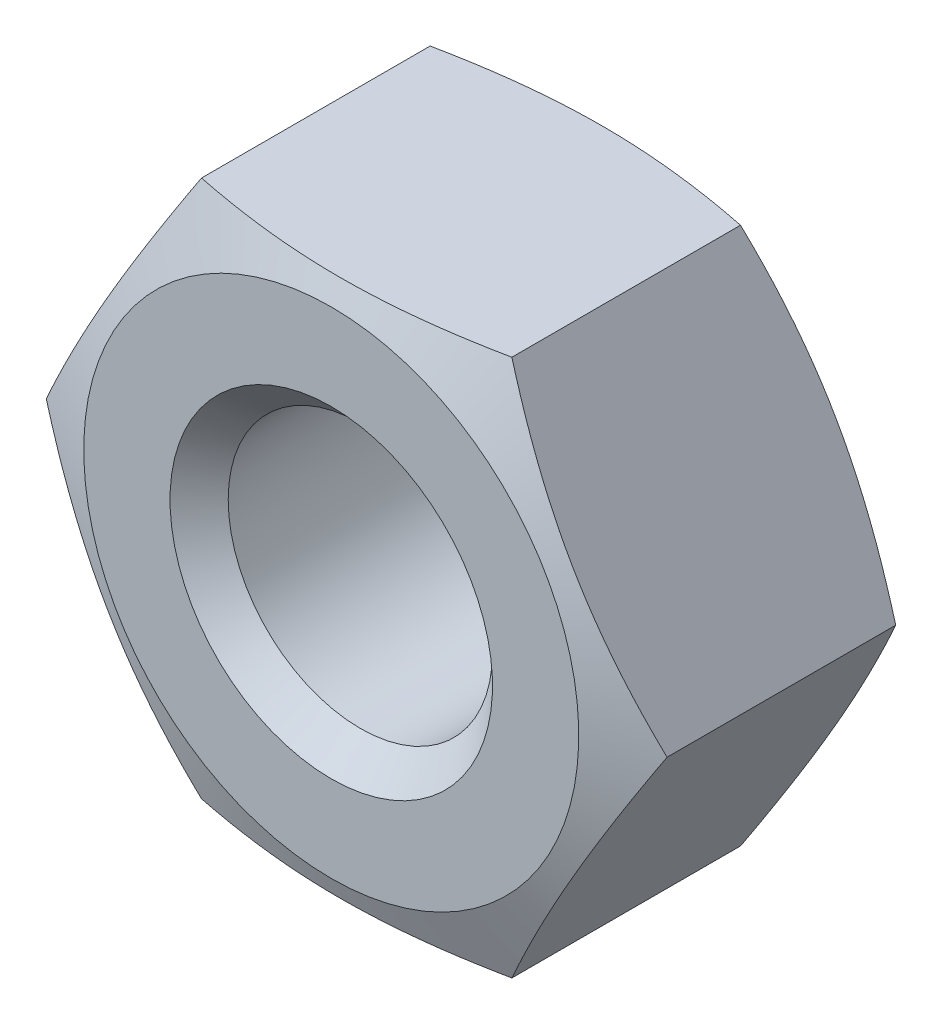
ISO-10303-21;
HEADER;
FILE_DESCRIPTION(('STEP AP214'),'2;1');
FILE_NAME('part.step','',(''),(''),'','','');
FILE_SCHEMA(('AUTOMOTIVE_DESIGN { 1 0 10303 214 1 1 1 1 }'));
ENDSEC;
DATA;
#1=APPLICATION_CONTEXT('core data for automotive mechanical design processes');
#2=APPLICATION_PROTOCOL_DEFINITION('international standard','automotive_design',2000,#1);
#3=PRODUCT_CONTEXT('',#1,'mechanical');
#4=PRODUCT('Part','Part','',(#3));
#5=PRODUCT_RELATED_PRODUCT_CATEGORY('part','',(#4));
#6=PRODUCT_DEFINITION_FORMATION('','',#4);
#7=PRODUCT_DEFINITION_CONTEXT('part definition',#1,'design');
#8=PRODUCT_DEFINITION('design','',#6,#7);
#9=PRODUCT_DEFINITION_SHAPE('','',#8);
#10=(LENGTH_UNIT() NAMED_UNIT(*) SI_UNIT(.MILLI.,.METRE.));
#11=(NAMED_UNIT(*) PLANE_ANGLE_UNIT() SI_UNIT($,.RADIAN.));
#12=(NAMED_UNIT(*) SI_UNIT($,.STERADIAN.) SOLID_ANGLE_UNIT());
#13=UNCERTAINTY_MEASURE_WITH_UNIT(LENGTH_MEASURE(1.E-05),#10,'distance_accuracy_value','');
#14=(GEOMETRIC_REPRESENTATION_CONTEXT(3) GLOBAL_UNCERTAINTY_ASSIGNED_CONTEXT((#13)) GLOBAL_UNIT_ASSIGNED_CONTEXT((#10,
#11,#12)) REPRESENTATION_CONTEXT('',''));
#15=CARTESIAN_POINT('',(0.,0.,0.));
#16=DIRECTION('',(0.,0.,1.));
#17=DIRECTION('',(1.,0.,0.));
#18=AXIS2_PLACEMENT_3D('',#15,#16,#17);
#19=CARTESIAN_POINT('',(5.775,0.,5.2));
#20=DIRECTION('',(0.,0.,1.));
#21=DIRECTION('',(1.,0.,0.));
#22=AXIS2_PLACEMENT_3D('',#19,#20,#21);
#23=PLANE('',#22);
#24=CARTESIAN_POINT('',(0.,0.,5.2));
#25=DIRECTION('',(0.,0.,-1.));
#26=DIRECTION('',(0.,1.,0.));
#27=AXIS2_PLACEMENT_3D('',#24,#25,#26);
#28=CIRCLE('',#27,3.);
#29=CARTESIAN_POINT('',(0.,3.,5.2));
#30=VERTEX_POINT('',#29);
#31=EDGE_CURVE('E206',#30,#30,#28,.T.);
#32=ORIENTED_EDGE('',*,*,#31,.T.);
#33=EDGE_LOOP('',(#32));
#34=FACE_BOUND('',#33,.T.);
#35=CARTESIAN_POINT('',(0.,0.,5.2));
#36=DIRECTION('',(0.,0.,-1.));
#37=DIRECTION('',(0.,1.,0.));
#38=AXIS2_PLACEMENT_3D('',#35,#36,#37);
#39=CIRCLE('',#38,4.60495894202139);
#40=CARTESIAN_POINT('',(0.,4.60495894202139,5.2));
#41=VERTEX_POINT('',#40);
#42=EDGE_CURVE('E209',#41,#41,#39,.T.);
#43=ORIENTED_EDGE('',*,*,#42,.F.);
#44=EDGE_LOOP('',(#43));
#45=FACE_BOUND('',#44,.T.);
#46=ADVANCED_FACE('F15',(#34,#45),#23,.T.);
#47=CARTESIAN_POINT('',(0.,0.,5.2));
#48=DIRECTION('',(0.,0.,1.));
#49=DIRECTION('',(0.,-1.,0.));
#50=AXIS2_PLACEMENT_3D('',#47,#48,#49);
#51=CONICAL_SURFACE('',#50,3.,0.785398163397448);
#52=CARTESIAN_POINT('',(0.,0.,4.65875));
#53=DIRECTION('',(0.,0.,-1.));
#54=DIRECTION('',(0.,1.,0.));
#55=AXIS2_PLACEMENT_3D('',#52,#53,#54);
#56=CIRCLE('',#55,2.45875);
#57=CARTESIAN_POINT('',(0.,2.45875,4.65875));
#58=VERTEX_POINT('',#57);
#59=EDGE_CURVE('E96',#58,#58,#56,.T.);
#60=ORIENTED_EDGE('',*,*,#59,.T.);
#61=EDGE_LOOP('',(#60));
#62=FACE_BOUND('',#61,.T.);
#63=ORIENTED_EDGE('',*,*,#31,.F.);
#64=EDGE_LOOP('',(#63));
#65=FACE_BOUND('',#64,.T.);
#66=ADVANCED_FACE('F139',(#62,#65),#51,.F.);
#67=CARTESIAN_POINT('',(0.,0.,0.));
#68=DIRECTION('',(0.,0.,-1.));
#69=DIRECTION('',(0.,1.,0.));
#70=AXIS2_PLACEMENT_3D('',#67,#68,#69);
#71=CYLINDRICAL_SURFACE('',#70,2.45875);
#72=CARTESIAN_POINT('',(0.,0.,0.54125));
#73=DIRECTION('',(0.,0.,-1.));
#74=DIRECTION('',(0.,1.,0.));
#75=AXIS2_PLACEMENT_3D('',#72,#73,#74);
#76=CIRCLE('',#75,2.45875);
#77=CARTESIAN_POINT('',(0.,2.45875,0.54125));
#78=VERTEX_POINT('',#77);
#79=EDGE_CURVE('E93',#78,#78,#76,.T.);
#80=ORIENTED_EDGE('',*,*,#79,.T.);
#81=EDGE_LOOP('',(#80));
#82=FACE_BOUND('',#81,.T.);
#83=ORIENTED_EDGE('',*,*,#59,.F.);
#84=EDGE_LOOP('',(#83));
#85=FACE_BOUND('',#84,.T.);
#86=ADVANCED_FACE('F201',(#82,#85),#71,.F.);
#87=CARTESIAN_POINT('',(0.,0.,0.));
#88=DIRECTION('',(0.,0.,-1.));
#89=DIRECTION('',(0.,1.,0.));
#90=AXIS2_PLACEMENT_3D('',#87,#88,#89);
#91=CONICAL_SURFACE('',#90,3.,0.785398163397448);
#92=ORIENTED_EDGE('',*,*,#79,.F.);
#93=EDGE_LOOP('',(#92));
#94=FACE_BOUND('',#93,.T.);
#95=CARTESIAN_POINT('',(0.,0.,0.));
#96=DIRECTION('',(0.,0.,-1.));
#97=DIRECTION('',(0.,1.,0.));
#98=AXIS2_PLACEMENT_3D('',#95,#96,#97);
#99=CIRCLE('',#98,3.);
#100=CARTESIAN_POINT('',(0.,3.,0.));
#101=VERTEX_POINT('',#100);
#102=EDGE_CURVE('E210',#101,#101,#99,.T.);
#103=ORIENTED_EDGE('',*,*,#102,.T.);
#104=EDGE_LOOP('',(#103));
#105=FACE_BOUND('',#104,.T.);
#106=ADVANCED_FACE('F137',(#94,#105),#91,.F.);
#107=CARTESIAN_POINT('',(0.,0.,4.72727272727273));
#108=DIRECTION('',(0.,0.,-1.));
#109=DIRECTION('',(0.,1.,0.));
#110=AXIS2_PLACEMENT_3D('',#107,#108,#109);
#111=CONICAL_SURFACE('',#110,5.775,1.18682389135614);
#112=ORIENTED_EDGE('',*,*,#42,.T.);
#113=EDGE_LOOP('',(#112));
#114=FACE_BOUND('',#113,.T.);
#115=CARTESIAN_POINT('',(-7.63252428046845,-5.00129670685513,3.37372353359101));
#116=CARTESIAN_POINT('',(-7.40692872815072,-5.00129670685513,3.4499392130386));
#117=CARTESIAN_POINT('',(-7.18103301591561,-5.00129670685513,3.52528282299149));
#118=CARTESIAN_POINT('',(-6.72848595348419,-5.00129670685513,3.67373862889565));
#119=CARTESIAN_POINT('',(-6.50183453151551,-5.00129670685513,3.74685060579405));
#120=CARTESIAN_POINT('',(-6.04711659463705,-5.00129670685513,3.89051397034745));
#121=CARTESIAN_POINT('',(-5.81904798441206,-5.00129670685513,3.961058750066));
#122=CARTESIAN_POINT('',(-5.36188060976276,-5.00129670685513,4.09872037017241));
#123=CARTESIAN_POINT('',(-5.13278187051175,-5.00129670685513,4.16583729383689));
#124=CARTESIAN_POINT('',(-4.67634647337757,-5.00129670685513,4.29493674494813));
#125=CARTESIAN_POINT('',(-4.44902554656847,-5.00129670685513,4.35697461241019));
#126=CARTESIAN_POINT('',(-3.99300093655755,-5.00129670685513,4.47580897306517));
#127=CARTESIAN_POINT('',(-3.7642972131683,-5.00129670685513,4.53260531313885));
#128=CARTESIAN_POINT('',(-3.30547385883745,-5.00129670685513,4.63959941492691));
#129=CARTESIAN_POINT('',(-3.07535509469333,-5.00129670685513,4.68980086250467));
#130=CARTESIAN_POINT('',(-2.6134821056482,-5.00129670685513,4.78205285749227));
#131=CARTESIAN_POINT('',(-2.38172799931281,-5.00129670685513,4.82410398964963));
#132=CARTESIAN_POINT('',(-1.96417992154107,-5.00129670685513,4.89070776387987));
#133=CARTESIAN_POINT('',(-1.77867771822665,-5.00129670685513,4.9170802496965));
#134=CARTESIAN_POINT('',(-1.40680055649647,-5.00129670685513,4.96267123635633));
#135=CARTESIAN_POINT('',(-1.22042567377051,-5.00129670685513,4.98189034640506));
#136=CARTESIAN_POINT('',(-0.847137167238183,-5.00129670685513,5.01241644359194));
#137=CARTESIAN_POINT('',(-0.660223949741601,-5.00129670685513,5.0237283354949));
#138=CARTESIAN_POINT('',(-0.286075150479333,-5.00129670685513,5.03796502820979));
#139=CARTESIAN_POINT('',(-0.0988395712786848,-5.00129670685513,5.04088989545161));
#140=CARTESIAN_POINT('',(0.276487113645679,-5.00129670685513,5.03821110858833));
#141=CARTESIAN_POINT('',(0.464577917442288,-5.00129670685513,5.03256560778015));
#142=CARTESIAN_POINT('',(0.840320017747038,-5.00129670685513,5.012928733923));
#143=CARTESIAN_POINT('',(1.02797130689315,-5.00129670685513,4.99893722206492));
#144=CARTESIAN_POINT('',(1.40264529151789,-5.00129670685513,4.96319595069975));
#145=CARTESIAN_POINT('',(1.58966750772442,-5.00129670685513,4.94144123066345));
#146=CARTESIAN_POINT('',(1.96276160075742,-5.00129670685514,4.89099430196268));
#147=CARTESIAN_POINT('',(2.14883348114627,-5.00129670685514,4.86230211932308));
#148=CARTESIAN_POINT('',(2.552742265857,-5.00129670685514,4.79328214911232));
#149=CARTESIAN_POINT('',(2.77037963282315,-5.00129670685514,4.75179408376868));
#150=CARTESIAN_POINT('',(3.20422689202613,-5.00129670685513,4.66191009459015));
#151=CARTESIAN_POINT('',(3.4204366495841,-5.00129670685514,4.6135135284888));
#152=CARTESIAN_POINT('',(3.85162355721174,-5.00129670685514,4.51107243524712));
#153=CARTESIAN_POINT('',(4.06660000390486,-5.00129670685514,4.45702496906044));
#154=CARTESIAN_POINT('',(4.49534169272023,-5.00129670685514,4.34438143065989));
#155=CARTESIAN_POINT('',(4.70910698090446,-5.00129670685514,4.28578553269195));
#156=CARTESIAN_POINT('',(5.13615898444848,-5.00129670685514,4.16475602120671));
#157=CARTESIAN_POINT('',(5.34944290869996,-5.00129670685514,4.10231260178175));
#158=CARTESIAN_POINT('',(5.77510931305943,-5.00129670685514,3.97442325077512));
#159=CARTESIAN_POINT('',(5.98749177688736,-5.00129670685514,3.90897726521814));
#160=CARTESIAN_POINT('',(6.62336729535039,-5.00129670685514,3.70903642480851));
#161=CARTESIAN_POINT('',(7.0457148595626,-5.00129670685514,3.57090210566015));
#162=CARTESIAN_POINT('',(7.88526486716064,-5.00129670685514,3.28906291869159));
#163=CARTESIAN_POINT('',(8.30248267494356,-5.00129670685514,3.14540337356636));
#164=CARTESIAN_POINT('',(9.13534876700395,-5.00129670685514,2.85351349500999));
#165=CARTESIAN_POINT('',(9.5509969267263,-5.00129670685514,2.7052828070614));
#166=CARTESIAN_POINT('',(10.3783206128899,-5.00129670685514,2.40652816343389));
#167=CARTESIAN_POINT('',(10.7900041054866,-5.00129670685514,2.25602620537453));
#168=CARTESIAN_POINT('',(11.4068301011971,-5.00129670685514,2.0284628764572));
#169=CARTESIAN_POINT('',(11.6123091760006,-5.00129670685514,1.9523116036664));
#170=CARTESIAN_POINT('',(12.0230684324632,-5.00129670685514,1.79947668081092));
#171=CARTESIAN_POINT('',(12.2283486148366,-5.00129670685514,1.72279303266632));
#172=CARTESIAN_POINT('',(12.4335427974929,-5.00129670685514,1.64587999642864));
#173=B_SPLINE_CURVE_WITH_KNOTS('',3,(#115,#116,#117,#118,#119,#120,#121,#122,#123,#124,#125,
#126,#127,#128,#129,#130,#131,#132,#133,#134,#135,#136,#137,#138,#139,#140,#141,#142,#143,#144,
#145,#146,#147,#148,#149,#150,#151,#152,#153,#154,#155,#156,#157,#158,#159,#160,#161,#162,#163,
#164,#165,#166,#167,#168,#169,#170,#171,#172),.UNSPECIFIED.,.F.,.F.,(4,2,2,2,2,2,2,2,2,2,2,2,2,
2,2,2,2,2,2,2,2,2,2,2,2,2,2,2,4),(0.,0.714372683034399,1.42881526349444,2.1449826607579,
2.86113265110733,3.5679862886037,4.27486056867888,4.98133808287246,5.68776489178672,
6.24974766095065,6.81168255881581,7.37326858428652,7.93485016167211,8.49918261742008,
9.06352445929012,9.62822755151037,10.192928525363,10.8574572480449,11.5220477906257,
12.1869857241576,12.8518981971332,13.5185816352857,14.1852770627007,15.5182733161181,
16.8420167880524,18.1658631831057,19.4808464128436,20.1382543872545,20.7956599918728),.UNSPECIFIED.);
#174=CARTESIAN_POINT('',(-2.8875,-5.00129670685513,4.72727272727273));
#175=VERTEX_POINT('',#174);
#176=CARTESIAN_POINT('',(2.8875,-5.00129670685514,4.72727272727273));
#177=VERTEX_POINT('',#176);
#178=EDGE_CURVE('E76',#175,#177,#173,.T.);
#179=ORIENTED_EDGE('',*,*,#178,.T.);
#180=CARTESIAN_POINT('',(2.88749988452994,-5.00129690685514,4.7272726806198));
#181=CARTESIAN_POINT('',(2.98838133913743,-4.82656510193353,4.76803377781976));
#182=CARTESIAN_POINT('',(3.08959576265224,-4.65125657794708,4.80572396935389));
#183=CARTESIAN_POINT('',(3.29269387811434,-4.29948032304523,4.8738041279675));
#184=CARTESIAN_POINT('',(3.39457792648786,-4.12301197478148,4.90418981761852));
#185=CARTESIAN_POINT('',(3.59887027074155,-3.76916725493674,4.95644441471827));
#186=CARTESIAN_POINT('',(3.70127840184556,-3.59179116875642,4.97831585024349));
#187=CARTESIAN_POINT('',(3.90647506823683,-3.23638011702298,5.01252838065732));
#188=CARTESIAN_POINT('',(4.00926351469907,-3.05834530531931,5.02487157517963));
#189=CARTESIAN_POINT('',(4.21327560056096,-2.70498600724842,5.03926004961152));
#190=CARTESIAN_POINT('',(4.31449617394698,-2.52966683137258,5.04147663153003));
#191=CARTESIAN_POINT('',(4.51687750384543,-2.1791320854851,5.03595848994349));
#192=CARTESIAN_POINT('',(4.61803825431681,-2.00391652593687,5.02822289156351));
#193=CARTESIAN_POINT('',(4.81999440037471,-1.65411822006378,5.00321623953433));
#194=CARTESIAN_POINT('',(4.92078998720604,-1.47953514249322,4.98595124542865));
#195=CARTESIAN_POINT('',(5.1218999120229,-1.13120253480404,4.94272250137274));
#196=CARTESIAN_POINT('',(5.22221429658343,-0.957452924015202,4.91675961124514));
#197=CARTESIAN_POINT('',(5.36007420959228,-0.718672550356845,4.87571979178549));
#198=CARTESIAN_POINT('',(5.39787092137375,-0.65320672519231,4.86390986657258));
#199=CARTESIAN_POINT('',(5.4733751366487,-0.522429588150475,4.83926160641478));
#200=CARTESIAN_POINT('',(5.51108265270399,-0.457118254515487,4.82642342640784));
#201=CARTESIAN_POINT('',(5.58654068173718,-0.326421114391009,4.79973234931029));
#202=CARTESIAN_POINT('',(5.62429089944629,-0.26103581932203,4.78587612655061));
#203=CARTESIAN_POINT('',(5.69970862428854,-0.130408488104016,4.75724675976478));
#204=CARTESIAN_POINT('',(5.73737612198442,-0.0651664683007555,4.74247351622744));
#205=CARTESIAN_POINT('',(5.77500011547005,2.00000000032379E-07,4.7272726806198));
#206=B_SPLINE_CURVE_WITH_KNOTS('',3,(#180,#181,#182,#183,#184,#185,#186,#187,#188,#189,#190,
#191,#192,#193,#194,#195,#196,#197,#198,#199,#200,#201,#202,#203,#204,#205),.UNSPECIFIED.,.F.,
.F.,(4,2,2,2,2,2,2,2,2,2,2,2,4),(0.,0.617560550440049,1.2354818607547,1.85321955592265,
2.47082108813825,3.07793560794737,3.68510350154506,4.29188575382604,4.89860804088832,
5.12813487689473,5.3576271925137,5.58790573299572,5.81820930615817),.UNSPECIFIED.);
#207=CARTESIAN_POINT('',(5.775,0.,4.72727272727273));
#208=VERTEX_POINT('',#207);
#209=EDGE_CURVE('E161',#177,#208,#206,.T.);
#210=ORIENTED_EDGE('',*,*,#209,.T.);
#211=CARTESIAN_POINT('',(5.77500011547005,-2.00000000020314E-07,4.7272726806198));
#212=CARTESIAN_POINT('',(5.67411866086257,0.174731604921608,4.76803377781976));
#213=CARTESIAN_POINT('',(5.57290423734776,0.350040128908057,4.8057239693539));
#214=CARTESIAN_POINT('',(5.36980612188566,0.701816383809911,4.8738041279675));
#215=CARTESIAN_POINT('',(5.26792207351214,0.878284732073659,4.90418981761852));
#216=CARTESIAN_POINT('',(5.06362972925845,1.2321294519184,4.95644441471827));
#217=CARTESIAN_POINT('',(4.96122159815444,1.40950553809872,4.97831585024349));
#218=CARTESIAN_POINT('',(4.75602493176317,1.76491658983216,5.01252838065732));
#219=CARTESIAN_POINT('',(4.65323648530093,1.94295140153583,5.02487157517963));
#220=CARTESIAN_POINT('',(4.44922439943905,2.29631069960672,5.03926004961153));
#221=CARTESIAN_POINT('',(4.34800382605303,2.47162987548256,5.04147663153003));
#222=CARTESIAN_POINT('',(4.14562249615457,2.82216462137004,5.03595848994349));
#223=CARTESIAN_POINT('',(4.04446174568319,2.99738018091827,5.02822289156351));
#224=CARTESIAN_POINT('',(3.84250559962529,3.34717848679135,5.00321623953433));
#225=CARTESIAN_POINT('',(3.74171001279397,3.52176156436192,4.98595124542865));
#226=CARTESIAN_POINT('',(3.5406000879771,3.8700941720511,4.94272250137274));
#227=CARTESIAN_POINT('',(3.44028570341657,4.04384378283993,4.91675961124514));
#228=CARTESIAN_POINT('',(3.30242579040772,4.28262415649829,4.87571979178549));
#229=CARTESIAN_POINT('',(3.26462907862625,4.34808998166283,4.86390986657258));
#230=CARTESIAN_POINT('',(3.1891248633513,4.47886711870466,4.83926160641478));
#231=CARTESIAN_POINT('',(3.15141734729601,4.54417845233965,4.82642342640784));
#232=CARTESIAN_POINT('',(3.07595931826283,4.67487559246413,4.79973234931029));
#233=CARTESIAN_POINT('',(3.03820910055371,4.74026088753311,4.78587612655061));
#234=CARTESIAN_POINT('',(2.96279137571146,4.87088821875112,4.75724675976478));
#235=CARTESIAN_POINT('',(2.92512387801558,4.93613023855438,4.74247351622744));
#236=CARTESIAN_POINT('',(2.88749988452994,5.00129690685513,4.7272726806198));
#237=B_SPLINE_CURVE_WITH_KNOTS('',3,(#211,#212,#213,#214,#215,#216,#217,#218,#219,#220,#221,
#222,#223,#224,#225,#226,#227,#228,#229,#230,#231,#232,#233,#234,#235,#236),.UNSPECIFIED.,.F.,
.F.,(4,2,2,2,2,2,2,2,2,2,2,2,4),(0.,0.617560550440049,1.2354818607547,1.85321955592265,
2.47082108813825,3.07793560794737,3.68510350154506,4.29188575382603,4.89860804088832,
5.12813487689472,5.35762719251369,5.58790573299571,5.81820930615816),.UNSPECIFIED.);
#238=CARTESIAN_POINT('',(2.8875,5.00129670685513,4.72727272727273));
#239=VERTEX_POINT('',#238);
#240=EDGE_CURVE('E38',#208,#239,#237,.T.);
#241=ORIENTED_EDGE('',*,*,#240,.T.);
#242=CARTESIAN_POINT('',(-7.63252428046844,5.00129670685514,3.37372353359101));
#243=CARTESIAN_POINT('',(-7.40692872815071,5.00129670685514,3.4499392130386));
#244=CARTESIAN_POINT('',(-7.1810330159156,5.00129670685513,3.52528282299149));
#245=CARTESIAN_POINT('',(-6.72848595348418,5.00129670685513,3.67373862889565));
#246=CARTESIAN_POINT('',(-6.50183453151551,5.00129670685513,3.74685060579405));
#247=CARTESIAN_POINT('',(-6.04711659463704,5.00129670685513,3.89051397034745));
#248=CARTESIAN_POINT('',(-5.81904798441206,5.00129670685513,3.961058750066));
#249=CARTESIAN_POINT('',(-5.36188060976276,5.00129670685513,4.09872037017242));
#250=CARTESIAN_POINT('',(-5.13278187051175,5.00129670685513,4.16583729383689));
#251=CARTESIAN_POINT('',(-4.67634647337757,5.00129670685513,4.29493674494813));
#252=CARTESIAN_POINT('',(-4.44902554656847,5.00129670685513,4.35697461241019));
#253=CARTESIAN_POINT('',(-3.99300093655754,5.00129670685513,4.47580897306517));
#254=CARTESIAN_POINT('',(-3.7642972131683,5.00129670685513,4.53260531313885));
#255=CARTESIAN_POINT('',(-3.30547385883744,5.00129670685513,4.63959941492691));
#256=CARTESIAN_POINT('',(-3.07535509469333,5.00129670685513,4.68980086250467));
#257=CARTESIAN_POINT('',(-2.61348210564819,5.00129670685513,4.78205285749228));
#258=CARTESIAN_POINT('',(-2.3817279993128,5.00129670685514,4.82410398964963));
#259=CARTESIAN_POINT('',(-1.96417992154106,5.00129670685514,4.89070776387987));
#260=CARTESIAN_POINT('',(-1.77867771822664,5.00129670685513,4.9170802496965));
#261=CARTESIAN_POINT('',(-1.40680055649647,5.00129670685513,4.96267123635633));
#262=CARTESIAN_POINT('',(-1.2204256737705,5.00129670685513,4.98189034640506));
#263=CARTESIAN_POINT('',(-0.847137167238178,5.00129670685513,5.01241644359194));
#264=CARTESIAN_POINT('',(-0.660223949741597,5.00129670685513,5.0237283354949));
#265=CARTESIAN_POINT('',(-0.286075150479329,5.00129670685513,5.03796502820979));
#266=CARTESIAN_POINT('',(-0.0988395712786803,5.00129670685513,5.04088989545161));
#267=CARTESIAN_POINT('',(0.276487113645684,5.00129670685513,5.03821110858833));
#268=CARTESIAN_POINT('',(0.464577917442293,5.00129670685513,5.03256560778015));
#269=CARTESIAN_POINT('',(0.840320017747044,5.00129670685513,5.012928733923));
#270=CARTESIAN_POINT('',(1.02797130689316,5.00129670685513,4.99893722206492));
#271=CARTESIAN_POINT('',(1.40264529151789,5.00129670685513,4.96319595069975));
#272=CARTESIAN_POINT('',(1.58966750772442,5.00129670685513,4.94144123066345));
#273=CARTESIAN_POINT('',(1.96276160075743,5.00129670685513,4.89099430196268));
#274=CARTESIAN_POINT('',(2.14883348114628,5.00129670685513,4.86230211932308));
#275=CARTESIAN_POINT('',(2.55274226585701,5.00129670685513,4.79328214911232));
#276=CARTESIAN_POINT('',(2.77037963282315,5.00129670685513,4.75179408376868));
#277=CARTESIAN_POINT('',(3.20422689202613,5.00129670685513,4.66191009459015));
#278=CARTESIAN_POINT('',(3.42043664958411,5.00129670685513,4.6135135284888));
#279=CARTESIAN_POINT('',(3.85162355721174,5.00129670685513,4.51107243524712));
#280=CARTESIAN_POINT('',(4.06660000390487,5.00129670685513,4.45702496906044));
#281=CARTESIAN_POINT('',(4.49534169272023,5.00129670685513,4.34438143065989));
#282=CARTESIAN_POINT('',(4.70910698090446,5.00129670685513,4.28578553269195));
#283=CARTESIAN_POINT('',(5.13615898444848,5.00129670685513,4.16475602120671));
#284=CARTESIAN_POINT('',(5.34944290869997,5.00129670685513,4.10231260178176));
#285=CARTESIAN_POINT('',(5.77510931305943,5.00129670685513,3.97442325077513));
#286=CARTESIAN_POINT('',(5.98749177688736,5.00129670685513,3.90897726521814));
#287=CARTESIAN_POINT('',(6.62336729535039,5.00129670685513,3.70903642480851));
#288=CARTESIAN_POINT('',(7.0457148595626,5.00129670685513,3.57090210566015));
#289=CARTESIAN_POINT('',(7.88526486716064,5.00129670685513,3.28906291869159));
#290=CARTESIAN_POINT('',(8.30248267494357,5.00129670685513,3.14540337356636));
#291=CARTESIAN_POINT('',(9.13534876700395,5.00129670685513,2.85351349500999));
#292=CARTESIAN_POINT('',(9.5509969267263,5.00129670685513,2.7052828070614));
#293=CARTESIAN_POINT('',(10.3783206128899,5.00129670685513,2.40652816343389));
#294=CARTESIAN_POINT('',(10.7900041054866,5.00129670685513,2.25602620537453));
#295=CARTESIAN_POINT('',(11.4068301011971,5.00129670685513,2.0284628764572));
#296=CARTESIAN_POINT('',(11.6123091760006,5.00129670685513,1.9523116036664));
#297=CARTESIAN_POINT('',(12.0230684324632,5.00129670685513,1.79947668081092));
#298=CARTESIAN_POINT('',(12.2283486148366,5.00129670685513,1.72279303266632));
#299=CARTESIAN_POINT('',(12.4335427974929,5.00129670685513,1.64587999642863));
#300=B_SPLINE_CURVE_WITH_KNOTS('',3,(#242,#243,#244,#245,#246,#247,#248,#249,#250,#251,#252,
#253,#254,#255,#256,#257,#258,#259,#260,#261,#262,#263,#264,#265,#266,#267,#268,#269,#270,#271,
#272,#273,#274,#275,#276,#277,#278,#279,#280,#281,#282,#283,#284,#285,#286,#287,#288,#289,#290,
#291,#292,#293,#294,#295,#296,#297,#298,#299),.UNSPECIFIED.,.F.,.F.,(4,2,2,2,2,2,2,2,2,2,2,2,2,
2,2,2,2,2,2,2,2,2,2,2,2,2,2,2,4),(0.,0.714372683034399,1.42881526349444,2.14498266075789,
2.86113265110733,3.5679862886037,4.27486056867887,4.98133808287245,5.68776489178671,
6.24974766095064,6.81168255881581,7.37326858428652,7.9348501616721,8.49918261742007,
9.06352445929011,9.62822755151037,10.192928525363,10.8574572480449,11.5220477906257,
12.1869857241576,12.8518981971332,13.5185816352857,14.1852770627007,15.5182733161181,
16.8420167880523,18.1658631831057,19.4808464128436,20.1382543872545,20.7956599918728),.UNSPECIFIED.);
#301=CARTESIAN_POINT('',(-2.8875,5.00129670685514,4.72727272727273));
#302=VERTEX_POINT('',#301);
#303=EDGE_CURVE('E152',#239,#302,#300,.F.);
#304=ORIENTED_EDGE('',*,*,#303,.T.);
#305=CARTESIAN_POINT('',(-2.88749988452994,5.00129690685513,4.7272726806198));
#306=CARTESIAN_POINT('',(-2.98838133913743,4.82656510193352,4.76803377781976));
#307=CARTESIAN_POINT('',(-3.08959576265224,4.65125657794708,4.80572396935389));
#308=CARTESIAN_POINT('',(-3.29269387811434,4.29948032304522,4.8738041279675));
#309=CARTESIAN_POINT('',(-3.39457792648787,4.12301197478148,4.90418981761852));
#310=CARTESIAN_POINT('',(-3.59887027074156,3.76916725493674,4.95644441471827));
#311=CARTESIAN_POINT('',(-3.70127840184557,3.59179116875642,4.97831585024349));
#312=CARTESIAN_POINT('',(-3.90647506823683,3.23638011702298,5.01252838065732));
#313=CARTESIAN_POINT('',(-4.00926351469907,3.05834530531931,5.02487157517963));
#314=CARTESIAN_POINT('',(-4.21327560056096,2.70498600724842,5.03926004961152));
#315=CARTESIAN_POINT('',(-4.31449617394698,2.52966683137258,5.04147663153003));
#316=CARTESIAN_POINT('',(-4.51687750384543,2.1791320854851,5.03595848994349));
#317=CARTESIAN_POINT('',(-4.61803825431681,2.00391652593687,5.02822289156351));
#318=CARTESIAN_POINT('',(-4.81999440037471,1.65411822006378,5.00321623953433));
#319=CARTESIAN_POINT('',(-4.92078998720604,1.47953514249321,4.98595124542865));
#320=CARTESIAN_POINT('',(-5.1218999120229,1.13120253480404,4.94272250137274));
#321=CARTESIAN_POINT('',(-5.22221429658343,0.957452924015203,4.91675961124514));
#322=CARTESIAN_POINT('',(-5.36007420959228,0.718672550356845,4.87571979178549));
#323=CARTESIAN_POINT('',(-5.39787092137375,0.65320672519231,4.86390986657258));
#324=CARTESIAN_POINT('',(-5.4733751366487,0.522429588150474,4.83926160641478));
#325=CARTESIAN_POINT('',(-5.511082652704,0.457118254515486,4.82642342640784));
#326=CARTESIAN_POINT('',(-5.58654068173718,0.326421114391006,4.79973234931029));
#327=CARTESIAN_POINT('',(-5.6242908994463,0.261035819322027,4.78587612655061));
#328=CARTESIAN_POINT('',(-5.69970862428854,0.130408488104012,4.75724675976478));
#329=CARTESIAN_POINT('',(-5.73737612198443,0.065166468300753,4.74247351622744));
#330=CARTESIAN_POINT('',(-5.77500011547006,-1.99999999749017E-07,4.7272726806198));
#331=B_SPLINE_CURVE_WITH_KNOTS('',3,(#305,#306,#307,#308,#309,#310,#311,#312,#313,#314,#315,
#316,#317,#318,#319,#320,#321,#322,#323,#324,#325,#326,#327,#328,#329,#330),.UNSPECIFIED.,.F.,
.F.,(4,2,2,2,2,2,2,2,2,2,2,2,4),(0.,0.617560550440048,1.2354818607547,1.85321955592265,
2.47082108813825,3.07793560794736,3.68510350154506,4.29188575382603,4.89860804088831,
5.12813487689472,5.35762719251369,5.58790573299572,5.81820930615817),.UNSPECIFIED.);
#332=CARTESIAN_POINT('',(-5.775,0.,4.72727272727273));
#333=VERTEX_POINT('',#332);
#334=EDGE_CURVE('E147',#302,#333,#331,.T.);
#335=ORIENTED_EDGE('',*,*,#334,.T.);
#336=CARTESIAN_POINT('',(-5.77500011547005,1.999999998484E-07,4.7272726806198));
#337=CARTESIAN_POINT('',(-5.67411866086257,-0.174731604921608,4.76803377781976));
#338=CARTESIAN_POINT('',(-5.57290423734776,-0.350040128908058,4.8057239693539));
#339=CARTESIAN_POINT('',(-5.36980612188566,-0.701816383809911,4.8738041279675));
#340=CARTESIAN_POINT('',(-5.26792207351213,-0.878284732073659,4.90418981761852));
#341=CARTESIAN_POINT('',(-5.06362972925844,-1.2321294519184,4.95644441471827));
#342=CARTESIAN_POINT('',(-4.96122159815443,-1.40950553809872,4.97831585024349));
#343=CARTESIAN_POINT('',(-4.75602493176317,-1.76491658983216,5.01252838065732));
#344=CARTESIAN_POINT('',(-4.65323648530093,-1.94295140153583,5.02487157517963));
#345=CARTESIAN_POINT('',(-4.44922439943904,-2.29631069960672,5.03926004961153));
#346=CARTESIAN_POINT('',(-4.34800382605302,-2.47162987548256,5.04147663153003));
#347=CARTESIAN_POINT('',(-4.14562249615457,-2.82216462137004,5.03595848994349));
#348=CARTESIAN_POINT('',(-4.04446174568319,-2.99738018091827,5.02822289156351));
#349=CARTESIAN_POINT('',(-3.84250559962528,-3.34717848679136,5.00321623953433));
#350=CARTESIAN_POINT('',(-3.74171001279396,-3.52176156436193,4.98595124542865));
#351=CARTESIAN_POINT('',(-3.5406000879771,-3.8700941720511,4.94272250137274));
#352=CARTESIAN_POINT('',(-3.44028570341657,-4.04384378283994,4.91675961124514));
#353=CARTESIAN_POINT('',(-3.30242579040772,-4.2826241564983,4.87571979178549));
#354=CARTESIAN_POINT('',(-3.26462907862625,-4.34808998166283,4.86390986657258));
#355=CARTESIAN_POINT('',(-3.1891248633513,-4.47886711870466,4.83926160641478));
#356=CARTESIAN_POINT('',(-3.15141734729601,-4.54417845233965,4.82642342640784));
#357=CARTESIAN_POINT('',(-3.07595931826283,-4.67487559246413,4.79973234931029));
#358=CARTESIAN_POINT('',(-3.03820910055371,-4.7402608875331,4.78587612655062));
#359=CARTESIAN_POINT('',(-2.96279137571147,-4.87088821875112,4.75724675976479));
#360=CARTESIAN_POINT('',(-2.92512387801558,-4.93613023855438,4.74247351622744));
#361=CARTESIAN_POINT('',(-2.88749988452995,-5.00129690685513,4.7272726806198));
#362=B_SPLINE_CURVE_WITH_KNOTS('',3,(#336,#337,#338,#339,#340,#341,#342,#343,#344,#345,#346,
#347,#348,#349,#350,#351,#352,#353,#354,#355,#356,#357,#358,#359,#360,#361),.UNSPECIFIED.,.F.,
.F.,(4,2,2,2,2,2,2,2,2,2,2,2,4),(0.,0.61756055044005,1.2354818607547,1.85321955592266,
2.47082108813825,3.07793560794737,3.68510350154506,4.29188575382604,4.89860804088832,
5.12813487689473,5.35762719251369,5.58790573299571,5.81820930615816),.UNSPECIFIED.);
#363=EDGE_CURVE('E124',#333,#175,#362,.T.);
#364=ORIENTED_EDGE('',*,*,#363,.T.);
#365=EDGE_LOOP('',(#179,#210,#241,#304,#335,#364));
#366=FACE_BOUND('',#365,.T.);
#367=ADVANCED_FACE('F133',(#114,#366),#111,.T.);
#368=CARTESIAN_POINT('',(2.8875,-5.00129670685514,5.2));
#369=DIRECTION('',(-0.866025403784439,0.5,0.));
#370=DIRECTION('',(-0.5,-0.866025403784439,0.));
#371=AXIS2_PLACEMENT_3D('',#368,#369,#370);
#372=PLANE('',#371);
#373=ORIENTED_EDGE('',*,*,#209,.F.);
#374=DIRECTION('',(0.,0.,-1.));
#375=VECTOR('',#374,1.);
#376=CARTESIAN_POINT('',(2.8875,-5.00129670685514,5.2));
#377=LINE('',#376,#375);
#378=CARTESIAN_POINT('',(2.8875,-5.00129670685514,0.472727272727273));
#379=VERTEX_POINT('',#378);
#380=EDGE_CURVE('E80',#177,#379,#377,.T.);
#381=ORIENTED_EDGE('',*,*,#380,.T.);
#382=CARTESIAN_POINT('',(5.77500011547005,2.E-07,0.472727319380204));
#383=CARTESIAN_POINT('',(5.67411866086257,-0.17473160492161,0.431966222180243));
#384=CARTESIAN_POINT('',(5.57290423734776,-0.350040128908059,0.394276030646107));
#385=CARTESIAN_POINT('',(5.36980612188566,-0.701816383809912,0.3261958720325));
#386=CARTESIAN_POINT('',(5.26792207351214,-0.87828473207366,0.295810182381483));
#387=CARTESIAN_POINT('',(5.06362972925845,-1.2321294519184,0.243555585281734));
#388=CARTESIAN_POINT('',(4.96122159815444,-1.40950553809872,0.221684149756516));
#389=CARTESIAN_POINT('',(4.75602493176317,-1.76491658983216,0.187471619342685));
#390=CARTESIAN_POINT('',(4.65323648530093,-1.94295140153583,0.17512842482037));
#391=CARTESIAN_POINT('',(4.44922439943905,-2.29631069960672,0.160739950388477));
#392=CARTESIAN_POINT('',(4.34800382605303,-2.47162987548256,0.158523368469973));
#393=CARTESIAN_POINT('',(4.14562249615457,-2.82216462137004,0.164041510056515));
#394=CARTESIAN_POINT('',(4.04446174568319,-2.99738018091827,0.171777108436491));
#395=CARTESIAN_POINT('',(3.84250559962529,-3.34717848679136,0.196783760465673));
#396=CARTESIAN_POINT('',(3.74171001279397,-3.52176156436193,0.214048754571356));
#397=CARTESIAN_POINT('',(3.5406000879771,-3.8700941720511,0.257277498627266));
#398=CARTESIAN_POINT('',(3.44028570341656,-4.04384378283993,0.283240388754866));
#399=CARTESIAN_POINT('',(3.30242579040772,-4.28262415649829,0.324280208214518));
#400=CARTESIAN_POINT('',(3.26462907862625,-4.34808998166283,0.336090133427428));
#401=CARTESIAN_POINT('',(3.1891248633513,-4.47886711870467,0.360738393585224));
#402=CARTESIAN_POINT('',(3.15141734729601,-4.54417845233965,0.373576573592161));
#403=CARTESIAN_POINT('',(3.07595931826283,-4.67487559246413,0.400267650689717));
#404=CARTESIAN_POINT('',(3.03820910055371,-4.74026088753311,0.414123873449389));
#405=CARTESIAN_POINT('',(2.96279137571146,-4.87088821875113,0.442753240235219));
#406=CARTESIAN_POINT('',(2.92512387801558,-4.93613023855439,0.457526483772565));
#407=CARTESIAN_POINT('',(2.88749988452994,-5.00129690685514,0.472727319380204));
#408=B_SPLINE_CURVE_WITH_KNOTS('',3,(#382,#383,#384,#385,#386,#387,#388,#389,#390,#391,#392,
#393,#394,#395,#396,#397,#398,#399,#400,#401,#402,#403,#404,#405,#406,#407),.UNSPECIFIED.,.F.,
.F.,(4,2,2,2,2,2,2,2,2,2,2,2,4),(0.,0.617560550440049,1.2354818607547,1.85321955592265,
2.47082108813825,3.07793560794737,3.68510350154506,4.29188575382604,4.89860804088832,
5.12813487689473,5.3576271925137,5.58790573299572,5.81820930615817),.UNSPECIFIED.);
#409=CARTESIAN_POINT('',(5.775,0.,0.472727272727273));
#410=VERTEX_POINT('',#409);
#411=EDGE_CURVE('E31',#410,#379,#408,.T.);
#412=ORIENTED_EDGE('',*,*,#411,.F.);
#413=DIRECTION('',(0.,0.,-1.));
#414=VECTOR('',#413,1.);
#415=CARTESIAN_POINT('',(5.775,0.,5.2));
#416=LINE('',#415,#414);
#417=EDGE_CURVE('E24',#208,#410,#416,.T.);
#418=ORIENTED_EDGE('',*,*,#417,.F.);
#419=EDGE_LOOP('',(#373,#381,#412,#418));
#420=FACE_BOUND('',#419,.T.);
#421=ADVANCED_FACE('F17',(#420),#372,.F.);
#422=CARTESIAN_POINT('',(5.775,0.,5.2));
#423=DIRECTION('',(-0.866025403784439,-0.5,0.));
#424=DIRECTION('',(0.5,-0.866025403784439,0.));
#425=AXIS2_PLACEMENT_3D('',#422,#423,#424);
#426=PLANE('',#425);
#427=ORIENTED_EDGE('',*,*,#240,.F.);
#428=ORIENTED_EDGE('',*,*,#417,.T.);
#429=CARTESIAN_POINT('',(2.88749988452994,5.00129690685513,0.472727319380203));
#430=CARTESIAN_POINT('',(2.98838133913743,4.82656510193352,0.431966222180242));
#431=CARTESIAN_POINT('',(3.08959576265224,4.65125657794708,0.394276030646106));
#432=CARTESIAN_POINT('',(3.29269387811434,4.29948032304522,0.326195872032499));
#433=CARTESIAN_POINT('',(3.39457792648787,4.12301197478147,0.295810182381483));
#434=CARTESIAN_POINT('',(3.59887027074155,3.76916725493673,0.243555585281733));
#435=CARTESIAN_POINT('',(3.70127840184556,3.59179116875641,0.221684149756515));
#436=CARTESIAN_POINT('',(3.90647506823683,3.23638011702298,0.187471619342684));
#437=CARTESIAN_POINT('',(4.00926351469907,3.05834530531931,0.175128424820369));
#438=CARTESIAN_POINT('',(4.21327560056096,2.70498600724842,0.160739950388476));
#439=CARTESIAN_POINT('',(4.31449617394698,2.52966683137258,0.158523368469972));
#440=CARTESIAN_POINT('',(4.51687750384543,2.1791320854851,0.164041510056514));
#441=CARTESIAN_POINT('',(4.61803825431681,2.00391652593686,0.17177710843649));
#442=CARTESIAN_POINT('',(4.81999440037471,1.65411822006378,0.196783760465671));
#443=CARTESIAN_POINT('',(4.92078998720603,1.47953514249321,0.214048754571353));
#444=CARTESIAN_POINT('',(5.1218999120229,1.13120253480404,0.257277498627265));
#445=CARTESIAN_POINT('',(5.22221429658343,0.957452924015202,0.283240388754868));
#446=CARTESIAN_POINT('',(5.36007420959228,0.718672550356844,0.324280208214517));
#447=CARTESIAN_POINT('',(5.39787092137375,0.653206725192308,0.336090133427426));
#448=CARTESIAN_POINT('',(5.4733751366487,0.522429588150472,0.360738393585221));
#449=CARTESIAN_POINT('',(5.51108265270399,0.457118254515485,0.373576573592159));
#450=CARTESIAN_POINT('',(5.58654068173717,0.326421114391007,0.400267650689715));
#451=CARTESIAN_POINT('',(5.62429089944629,0.261035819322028,0.414123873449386));
#452=CARTESIAN_POINT('',(5.69970862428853,0.130408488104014,0.442753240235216));
#453=CARTESIAN_POINT('',(5.73737612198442,0.0651664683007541,0.457526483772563));
#454=CARTESIAN_POINT('',(5.77500011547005,-2.00000000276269E-07,0.472727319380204));
#455=B_SPLINE_CURVE_WITH_KNOTS('',3,(#429,#430,#431,#432,#433,#434,#435,#436,#437,#438,#439,
#440,#441,#442,#443,#444,#445,#446,#447,#448,#449,#450,#451,#452,#453,#454),.UNSPECIFIED.,.F.,
.F.,(4,2,2,2,2,2,2,2,2,2,2,2,4),(0.,0.617560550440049,1.2354818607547,1.85321955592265,
2.47082108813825,3.07793560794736,3.68510350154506,4.29188575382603,4.89860804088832,
5.12813487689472,5.35762719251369,5.58790573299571,5.81820930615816),.UNSPECIFIED.);
#456=CARTESIAN_POINT('',(2.8875,5.00129670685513,0.472727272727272));
#457=VERTEX_POINT('',#456);
#458=EDGE_CURVE('E172',#457,#410,#455,.T.);
#459=ORIENTED_EDGE('',*,*,#458,.F.);
#460=DIRECTION('',(0.,0.,-1.));
#461=VECTOR('',#460,1.);
#462=CARTESIAN_POINT('',(2.8875,5.00129670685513,5.2));
#463=LINE('',#462,#461);
#464=EDGE_CURVE('E292',#239,#457,#463,.T.);
#465=ORIENTED_EDGE('',*,*,#464,.F.);
#466=EDGE_LOOP('',(#427,#428,#459,#465));
#467=FACE_BOUND('',#466,.T.);
#468=ADVANCED_FACE('F166',(#467),#426,.F.);
#469=CARTESIAN_POINT('',(2.8875,5.00129670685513,5.2));
#470=DIRECTION('',(0.,-1.,0.));
#471=DIRECTION('',(1.,0.,0.));
#472=AXIS2_PLACEMENT_3D('',#469,#470,#471);
#473=PLANE('',#472);
#474=ORIENTED_EDGE('',*,*,#303,.F.);
#475=ORIENTED_EDGE('',*,*,#464,.T.);
#476=CARTESIAN_POINT('',(-7.63252428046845,5.00129670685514,1.82627646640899));
#477=CARTESIAN_POINT('',(-7.40692872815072,5.00129670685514,1.7500607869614));
#478=CARTESIAN_POINT('',(-7.18103301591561,5.00129670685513,1.67471717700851));
#479=CARTESIAN_POINT('',(-6.72848595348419,5.00129670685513,1.52626137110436));
#480=CARTESIAN_POINT('',(-6.50183453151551,5.00129670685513,1.45314939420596));
#481=CARTESIAN_POINT('',(-6.04711659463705,5.00129670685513,1.30948602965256));
#482=CARTESIAN_POINT('',(-5.81904798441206,5.00129670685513,1.238941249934));
#483=CARTESIAN_POINT('',(-5.36188060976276,5.00129670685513,1.10127962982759));
#484=CARTESIAN_POINT('',(-5.13278187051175,5.00129670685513,1.03416270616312));
#485=CARTESIAN_POINT('',(-4.67634647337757,5.00129670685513,0.905063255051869));
#486=CARTESIAN_POINT('',(-4.44902554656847,5.00129670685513,0.843025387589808));
#487=CARTESIAN_POINT('',(-3.99300093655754,5.00129670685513,0.724191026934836));
#488=CARTESIAN_POINT('',(-3.7642972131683,5.00129670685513,0.667394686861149));
#489=CARTESIAN_POINT('',(-3.30547385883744,5.00129670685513,0.560400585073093));
#490=CARTESIAN_POINT('',(-3.07535509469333,5.00129670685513,0.510199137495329));
#491=CARTESIAN_POINT('',(-2.61348210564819,5.00129670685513,0.417947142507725));
#492=CARTESIAN_POINT('',(-2.3817279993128,5.00129670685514,0.375896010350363));
#493=CARTESIAN_POINT('',(-1.96417992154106,5.00129670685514,0.309292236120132));
#494=CARTESIAN_POINT('',(-1.77867771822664,5.00129670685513,0.282919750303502));
#495=CARTESIAN_POINT('',(-1.40680055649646,5.00129670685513,0.237328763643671));
#496=CARTESIAN_POINT('',(-1.2204256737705,5.00129670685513,0.218109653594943));
#497=CARTESIAN_POINT('',(-0.847137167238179,5.00129670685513,0.187583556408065));
#498=CARTESIAN_POINT('',(-0.660223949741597,5.00129670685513,0.176271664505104));
#499=CARTESIAN_POINT('',(-0.286075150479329,5.00129670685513,0.162034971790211));
#500=CARTESIAN_POINT('',(-0.0988395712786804,5.00129670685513,0.159110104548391));
#501=CARTESIAN_POINT('',(0.276487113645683,5.00129670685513,0.161788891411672));
#502=CARTESIAN_POINT('',(0.464577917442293,5.00129670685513,0.167434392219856));
#503=CARTESIAN_POINT('',(0.840320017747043,5.00129670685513,0.187071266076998));
#504=CARTESIAN_POINT('',(1.02797130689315,5.00129670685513,0.201062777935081));
#505=CARTESIAN_POINT('',(1.40264529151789,5.00129670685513,0.236804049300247));
#506=CARTESIAN_POINT('',(1.58966750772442,5.00129670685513,0.258558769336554));
#507=CARTESIAN_POINT('',(1.96276160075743,5.00129670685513,0.309005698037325));
#508=CARTESIAN_POINT('',(2.14883348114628,5.00129670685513,0.337697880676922));
#509=CARTESIAN_POINT('',(2.552742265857,5.00129670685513,0.406717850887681));
#510=CARTESIAN_POINT('',(2.77037963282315,5.00129670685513,0.448205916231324));
#511=CARTESIAN_POINT('',(3.20422689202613,5.00129670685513,0.538089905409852));
#512=CARTESIAN_POINT('',(3.42043664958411,5.00129670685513,0.586486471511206));
#513=CARTESIAN_POINT('',(3.85162355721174,5.00129670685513,0.688927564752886));
#514=CARTESIAN_POINT('',(4.06660000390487,5.00129670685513,0.742975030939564));
#515=CARTESIAN_POINT('',(4.49534169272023,5.00129670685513,0.855618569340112));
#516=CARTESIAN_POINT('',(4.70910698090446,5.00129670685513,0.914214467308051));
#517=CARTESIAN_POINT('',(5.13615898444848,5.00129670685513,1.03524397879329));
#518=CARTESIAN_POINT('',(5.34944290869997,5.00129670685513,1.09768739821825));
#519=CARTESIAN_POINT('',(5.77510931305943,5.00129670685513,1.22557674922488));
#520=CARTESIAN_POINT('',(5.98749177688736,5.00129670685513,1.29102273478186));
#521=CARTESIAN_POINT('',(6.62336729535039,5.00129670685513,1.49096357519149));
#522=CARTESIAN_POINT('',(7.0457148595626,5.00129670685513,1.62909789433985));
#523=CARTESIAN_POINT('',(7.88526486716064,5.00129670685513,1.91093708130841));
#524=CARTESIAN_POINT('',(8.30248267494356,5.00129670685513,2.05459662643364));
#525=CARTESIAN_POINT('',(9.13534876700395,5.00129670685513,2.34648650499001));
#526=CARTESIAN_POINT('',(9.5509969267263,5.00129670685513,2.4947171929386));
#527=CARTESIAN_POINT('',(10.3783206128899,5.00129670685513,2.79347183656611));
#528=CARTESIAN_POINT('',(10.7900041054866,5.00129670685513,2.94397379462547));
#529=CARTESIAN_POINT('',(11.4068301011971,5.00129670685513,3.17153712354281));
#530=CARTESIAN_POINT('',(11.6123091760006,5.00129670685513,3.2476883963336));
#531=CARTESIAN_POINT('',(12.0230684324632,5.00129670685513,3.40052331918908));
#532=CARTESIAN_POINT('',(12.2283486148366,5.00129670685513,3.47720696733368));
#533=CARTESIAN_POINT('',(12.4335427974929,5.00129670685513,3.55412000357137));
#534=B_SPLINE_CURVE_WITH_KNOTS('',3,(#476,#477,#478,#479,#480,#481,#482,#483,#484,#485,#486,
#487,#488,#489,#490,#491,#492,#493,#494,#495,#496,#497,#498,#499,#500,#501,#502,#503,#504,#505,
#506,#507,#508,#509,#510,#511,#512,#513,#514,#515,#516,#517,#518,#519,#520,#521,#522,#523,#524,
#525,#526,#527,#528,#529,#530,#531,#532,#533),.UNSPECIFIED.,.F.,.F.,(4,2,2,2,2,2,2,2,2,2,2,2,2,
2,2,2,2,2,2,2,2,2,2,2,2,2,2,2,4),(0.,0.714372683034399,1.42881526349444,2.1449826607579,
2.86113265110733,3.5679862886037,4.27486056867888,4.98133808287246,5.68776489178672,
6.24974766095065,6.81168255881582,7.37326858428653,7.93485016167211,8.49918261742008,
9.06352445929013,9.62822755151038,10.192928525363,10.8574572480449,11.5220477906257,
12.1869857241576,12.8518981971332,13.5185816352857,14.1852770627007,15.5182733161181,
16.8420167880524,18.1658631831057,19.4808464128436,20.1382543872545,20.7956599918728),.UNSPECIFIED.);
#535=CARTESIAN_POINT('',(-2.8875,5.00129670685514,0.472727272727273));
#536=VERTEX_POINT('',#535);
#537=EDGE_CURVE('E177',#536,#457,#534,.T.);
#538=ORIENTED_EDGE('',*,*,#537,.F.);
#539=DIRECTION('',(0.,0.,-1.));
#540=VECTOR('',#539,1.);
#541=CARTESIAN_POINT('',(-2.8875,5.00129670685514,5.2));
#542=LINE('',#541,#540);
#543=EDGE_CURVE('E294',#302,#536,#542,.T.);
#544=ORIENTED_EDGE('',*,*,#543,.F.);
#545=EDGE_LOOP('',(#474,#475,#538,#544));
#546=FACE_BOUND('',#545,.T.);
#547=ADVANCED_FACE('F169',(#546),#473,.F.);
#548=CARTESIAN_POINT('',(-2.8875,5.00129670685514,5.2));
#549=DIRECTION('',(0.866025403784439,-0.5,0.));
#550=DIRECTION('',(0.5,0.866025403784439,0.));
#551=AXIS2_PLACEMENT_3D('',#548,#549,#550);
#552=PLANE('',#551);
#553=ORIENTED_EDGE('',*,*,#334,.F.);
#554=ORIENTED_EDGE('',*,*,#543,.T.);
#555=CARTESIAN_POINT('',(-5.77500011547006,-2.E-07,0.472727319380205));
#556=CARTESIAN_POINT('',(-5.67411866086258,0.174731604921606,0.431966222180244));
#557=CARTESIAN_POINT('',(-5.57290423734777,0.350040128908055,0.394276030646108));
#558=CARTESIAN_POINT('',(-5.36980612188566,0.701816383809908,0.3261958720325));
#559=CARTESIAN_POINT('',(-5.26792207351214,0.878284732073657,0.295810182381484));
#560=CARTESIAN_POINT('',(-5.06362972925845,1.2321294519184,0.243555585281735));
#561=CARTESIAN_POINT('',(-4.96122159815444,1.40950553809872,0.221684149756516));
#562=CARTESIAN_POINT('',(-4.75602493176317,1.76491658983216,0.187471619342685));
#563=CARTESIAN_POINT('',(-4.65323648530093,1.94295140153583,0.17512842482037));
#564=CARTESIAN_POINT('',(-4.44922439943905,2.29631069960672,0.160739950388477));
#565=CARTESIAN_POINT('',(-4.34800382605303,2.47162987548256,0.158523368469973));
#566=CARTESIAN_POINT('',(-4.14562249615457,2.82216462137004,0.164041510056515));
#567=CARTESIAN_POINT('',(-4.04446174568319,2.99738018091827,0.171777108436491));
#568=CARTESIAN_POINT('',(-3.84250559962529,3.34717848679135,0.196783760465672));
#569=CARTESIAN_POINT('',(-3.74171001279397,3.52176156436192,0.214048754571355));
#570=CARTESIAN_POINT('',(-3.5406000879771,3.8700941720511,0.257277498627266));
#571=CARTESIAN_POINT('',(-3.44028570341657,4.04384378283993,0.283240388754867));
#572=CARTESIAN_POINT('',(-3.30242579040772,4.28262415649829,0.324280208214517));
#573=CARTESIAN_POINT('',(-3.26462907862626,4.34808998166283,0.336090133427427));
#574=CARTESIAN_POINT('',(-3.1891248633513,4.47886711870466,0.360738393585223));
#575=CARTESIAN_POINT('',(-3.15141734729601,4.54417845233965,0.37357657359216));
#576=CARTESIAN_POINT('',(-3.07595931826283,4.67487559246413,0.400267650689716));
#577=CARTESIAN_POINT('',(-3.03820910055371,4.74026088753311,0.414123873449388));
#578=CARTESIAN_POINT('',(-2.96279137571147,4.87088821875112,0.442753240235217));
#579=CARTESIAN_POINT('',(-2.92512387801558,4.93613023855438,0.457526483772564));
#580=CARTESIAN_POINT('',(-2.88749988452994,5.00129690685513,0.472727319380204));
#581=B_SPLINE_CURVE_WITH_KNOTS('',3,(#555,#556,#557,#558,#559,#560,#561,#562,#563,#564,#565,
#566,#567,#568,#569,#570,#571,#572,#573,#574,#575,#576,#577,#578,#579,#580),.UNSPECIFIED.,.F.,
.F.,(4,2,2,2,2,2,2,2,2,2,2,2,4),(0.,0.61756055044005,1.23548186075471,1.85321955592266,
2.47082108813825,3.07793560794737,3.68510350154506,4.29188575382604,4.89860804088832,
5.12813487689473,5.3576271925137,5.58790573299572,5.81820930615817),.UNSPECIFIED.);
#582=CARTESIAN_POINT('',(-5.775,0.,0.472727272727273));
#583=VERTEX_POINT('',#582);
#584=EDGE_CURVE('E89',#583,#536,#581,.T.);
#585=ORIENTED_EDGE('',*,*,#584,.F.);
#586=DIRECTION('',(0.,0.,-1.));
#587=VECTOR('',#586,1.);
#588=CARTESIAN_POINT('',(-5.775,0.,5.2));
#589=LINE('',#588,#587);
#590=EDGE_CURVE('E79',#333,#583,#589,.T.);
#591=ORIENTED_EDGE('',*,*,#590,.F.);
#592=EDGE_LOOP('',(#553,#554,#585,#591));
#593=FACE_BOUND('',#592,.T.);
#594=ADVANCED_FACE('F185',(#593),#552,.F.);
#595=CARTESIAN_POINT('',(-5.775,0.,5.2));
#596=DIRECTION('',(0.866025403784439,0.5,0.));
#597=DIRECTION('',(-0.5,0.866025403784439,0.));
#598=AXIS2_PLACEMENT_3D('',#595,#596,#597);
#599=PLANE('',#598);
#600=ORIENTED_EDGE('',*,*,#363,.F.);
#601=ORIENTED_EDGE('',*,*,#590,.T.);
#602=CARTESIAN_POINT('',(-2.88749988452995,-5.00129690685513,0.472727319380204));
#603=CARTESIAN_POINT('',(-2.98838133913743,-4.82656510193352,0.431966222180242));
#604=CARTESIAN_POINT('',(-3.08959576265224,-4.65125657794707,0.394276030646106));
#605=CARTESIAN_POINT('',(-3.29269387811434,-4.29948032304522,0.326195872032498));
#606=CARTESIAN_POINT('',(-3.39457792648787,-4.12301197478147,0.295810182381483));
#607=CARTESIAN_POINT('',(-3.59887027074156,-3.76916725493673,0.243555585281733));
#608=CARTESIAN_POINT('',(-3.70127840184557,-3.59179116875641,0.221684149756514));
#609=CARTESIAN_POINT('',(-3.90647506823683,-3.23638011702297,0.187471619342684));
#610=CARTESIAN_POINT('',(-4.00926351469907,-3.0583453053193,0.175128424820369));
#611=CARTESIAN_POINT('',(-4.21327560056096,-2.70498600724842,0.160739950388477));
#612=CARTESIAN_POINT('',(-4.31449617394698,-2.52966683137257,0.158523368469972));
#613=CARTESIAN_POINT('',(-4.51687750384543,-2.17913208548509,0.164041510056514));
#614=CARTESIAN_POINT('',(-4.61803825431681,-2.00391652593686,0.17177710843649));
#615=CARTESIAN_POINT('',(-4.81999440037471,-1.65411822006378,0.196783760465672));
#616=CARTESIAN_POINT('',(-4.92078998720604,-1.47953514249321,0.214048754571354));
#617=CARTESIAN_POINT('',(-5.1218999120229,-1.13120253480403,0.257277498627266));
#618=CARTESIAN_POINT('',(-5.22221429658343,-0.957452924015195,0.283240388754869));
#619=CARTESIAN_POINT('',(-5.36007420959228,-0.718672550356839,0.324280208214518));
#620=CARTESIAN_POINT('',(-5.39787092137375,-0.653206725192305,0.336090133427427));
#621=CARTESIAN_POINT('',(-5.4733751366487,-0.52242958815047,0.360738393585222));
#622=CARTESIAN_POINT('',(-5.51108265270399,-0.457118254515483,0.373576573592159));
#623=CARTESIAN_POINT('',(-5.58654068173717,-0.326421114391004,0.400267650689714));
#624=CARTESIAN_POINT('',(-5.62429089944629,-0.261035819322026,0.414123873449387));
#625=CARTESIAN_POINT('',(-5.69970862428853,-0.130408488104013,0.442753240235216));
#626=CARTESIAN_POINT('',(-5.73737612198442,-0.0651664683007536,0.457526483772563));
#627=CARTESIAN_POINT('',(-5.77500011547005,1.99999999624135E-07,0.472727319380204));
#628=B_SPLINE_CURVE_WITH_KNOTS('',3,(#602,#603,#604,#605,#606,#607,#608,#609,#610,#611,#612,
#613,#614,#615,#616,#617,#618,#619,#620,#621,#622,#623,#624,#625,#626,#627),.UNSPECIFIED.,.F.,
.F.,(4,2,2,2,2,2,2,2,2,2,2,2,4),(0.,0.617560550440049,1.2354818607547,1.85321955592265,
2.47082108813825,3.07793560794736,3.68510350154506,4.29188575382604,4.89860804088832,
5.12813487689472,5.35762719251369,5.58790573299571,5.81820930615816),.UNSPECIFIED.);
#629=CARTESIAN_POINT('',(-2.8875,-5.00129670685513,0.472727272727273));
#630=VERTEX_POINT('',#629);
#631=EDGE_CURVE('E84',#630,#583,#628,.T.);
#632=ORIENTED_EDGE('',*,*,#631,.F.);
#633=DIRECTION('',(0.,0.,-1.));
#634=VECTOR('',#633,1.);
#635=CARTESIAN_POINT('',(-2.8875,-5.00129670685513,5.2));
#636=LINE('',#635,#634);
#637=EDGE_CURVE('E70',#175,#630,#636,.T.);
#638=ORIENTED_EDGE('',*,*,#637,.F.);
#639=EDGE_LOOP('',(#600,#601,#632,#638));
#640=FACE_BOUND('',#639,.T.);
#641=ADVANCED_FACE('F85',(#640),#599,.F.);
#642=CARTESIAN_POINT('',(-2.8875,-5.00129670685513,5.2));
#643=DIRECTION('',(0.,1.,0.));
#644=DIRECTION('',(-1.,0.,0.));
#645=AXIS2_PLACEMENT_3D('',#642,#643,#644);
#646=PLANE('',#645);
#647=ORIENTED_EDGE('',*,*,#178,.F.);
#648=ORIENTED_EDGE('',*,*,#637,.T.);
#649=CARTESIAN_POINT('',(-7.63252428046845,-5.00129670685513,1.82627646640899));
#650=CARTESIAN_POINT('',(-7.40692872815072,-5.00129670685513,1.7500607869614));
#651=CARTESIAN_POINT('',(-7.18103301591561,-5.00129670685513,1.67471717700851));
#652=CARTESIAN_POINT('',(-6.72848595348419,-5.00129670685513,1.52626137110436));
#653=CARTESIAN_POINT('',(-6.50183453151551,-5.00129670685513,1.45314939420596));
#654=CARTESIAN_POINT('',(-6.04711659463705,-5.00129670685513,1.30948602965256));
#655=CARTESIAN_POINT('',(-5.81904798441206,-5.00129670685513,1.238941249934));
#656=CARTESIAN_POINT('',(-5.36188060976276,-5.00129670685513,1.10127962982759));
#657=CARTESIAN_POINT('',(-5.13278187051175,-5.00129670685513,1.03416270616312));
#658=CARTESIAN_POINT('',(-4.67634647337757,-5.00129670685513,0.905063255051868));
#659=CARTESIAN_POINT('',(-4.44902554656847,-5.00129670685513,0.843025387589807));
#660=CARTESIAN_POINT('',(-3.99300093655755,-5.00129670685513,0.724191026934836));
#661=CARTESIAN_POINT('',(-3.7642972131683,-5.00129670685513,0.667394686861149));
#662=CARTESIAN_POINT('',(-3.30547385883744,-5.00129670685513,0.560400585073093));
#663=CARTESIAN_POINT('',(-3.07535509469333,-5.00129670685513,0.51019913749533));
#664=CARTESIAN_POINT('',(-2.6134821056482,-5.00129670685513,0.417947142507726));
#665=CARTESIAN_POINT('',(-2.38172799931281,-5.00129670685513,0.375896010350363));
#666=CARTESIAN_POINT('',(-1.96417992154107,-5.00129670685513,0.309292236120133));
#667=CARTESIAN_POINT('',(-1.77867771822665,-5.00129670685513,0.282919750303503));
#668=CARTESIAN_POINT('',(-1.40680055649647,-5.00129670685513,0.237328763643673));
#669=CARTESIAN_POINT('',(-1.22042567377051,-5.00129670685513,0.218109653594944));
#670=CARTESIAN_POINT('',(-0.847137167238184,-5.00129670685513,0.187583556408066));
#671=CARTESIAN_POINT('',(-0.660223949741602,-5.00129670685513,0.176271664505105));
#672=CARTESIAN_POINT('',(-0.286075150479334,-5.00129670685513,0.162034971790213));
#673=CARTESIAN_POINT('',(-0.0988395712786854,-5.00129670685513,0.159110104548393));
#674=CARTESIAN_POINT('',(0.276487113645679,-5.00129670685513,0.161788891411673));
#675=CARTESIAN_POINT('',(0.464577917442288,-5.00129670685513,0.167434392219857));
#676=CARTESIAN_POINT('',(0.840320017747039,-5.00129670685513,0.187071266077));
#677=CARTESIAN_POINT('',(1.02797130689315,-5.00129670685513,0.201062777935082));
#678=CARTESIAN_POINT('',(1.40264529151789,-5.00129670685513,0.236804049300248));
#679=CARTESIAN_POINT('',(1.58966750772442,-5.00129670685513,0.258558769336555));
#680=CARTESIAN_POINT('',(1.96276160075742,-5.00129670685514,0.309005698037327));
#681=CARTESIAN_POINT('',(2.14883348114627,-5.00129670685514,0.337697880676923));
#682=CARTESIAN_POINT('',(2.552742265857,-5.00129670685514,0.406717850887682));
#683=CARTESIAN_POINT('',(2.77037963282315,-5.00129670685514,0.448205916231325));
#684=CARTESIAN_POINT('',(3.20422689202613,-5.00129670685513,0.538089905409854));
#685=CARTESIAN_POINT('',(3.4204366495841,-5.00129670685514,0.586486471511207));
#686=CARTESIAN_POINT('',(3.85162355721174,-5.00129670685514,0.688927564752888));
#687=CARTESIAN_POINT('',(4.06660000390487,-5.00129670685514,0.742975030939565));
#688=CARTESIAN_POINT('',(4.49534169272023,-5.00129670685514,0.855618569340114));
#689=CARTESIAN_POINT('',(4.70910698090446,-5.00129670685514,0.914214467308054));
#690=CARTESIAN_POINT('',(5.13615898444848,-5.00129670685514,1.03524397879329));
#691=CARTESIAN_POINT('',(5.34944290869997,-5.00129670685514,1.09768739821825));
#692=CARTESIAN_POINT('',(5.77510931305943,-5.00129670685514,1.22557674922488));
#693=CARTESIAN_POINT('',(5.98749177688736,-5.00129670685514,1.29102273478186));
#694=CARTESIAN_POINT('',(6.62336729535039,-5.00129670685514,1.4909635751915));
#695=CARTESIAN_POINT('',(7.0457148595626,-5.00129670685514,1.62909789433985));
#696=CARTESIAN_POINT('',(7.88526486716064,-5.00129670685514,1.91093708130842));
#697=CARTESIAN_POINT('',(8.30248267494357,-5.00129670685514,2.05459662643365));
#698=CARTESIAN_POINT('',(9.13534876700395,-5.00129670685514,2.34648650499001));
#699=CARTESIAN_POINT('',(9.55099692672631,-5.00129670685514,2.49471719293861));
#700=CARTESIAN_POINT('',(10.3783206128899,-5.00129670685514,2.79347183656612));
#701=CARTESIAN_POINT('',(10.7900041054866,-5.00129670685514,2.94397379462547));
#702=CARTESIAN_POINT('',(11.4068301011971,-5.00129670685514,3.17153712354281));
#703=CARTESIAN_POINT('',(11.6123091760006,-5.00129670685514,3.2476883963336));
#704=CARTESIAN_POINT('',(12.0230684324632,-5.00129670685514,3.40052331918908));
#705=CARTESIAN_POINT('',(12.2283486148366,-5.00129670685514,3.47720696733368));
#706=CARTESIAN_POINT('',(12.4335427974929,-5.00129670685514,3.55412000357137));
#707=B_SPLINE_CURVE_WITH_KNOTS('',3,(#649,#650,#651,#652,#653,#654,#655,#656,#657,#658,#659,
#660,#661,#662,#663,#664,#665,#666,#667,#668,#669,#670,#671,#672,#673,#674,#675,#676,#677,#678,
#679,#680,#681,#682,#683,#684,#685,#686,#687,#688,#689,#690,#691,#692,#693,#694,#695,#696,#697,
#698,#699,#700,#701,#702,#703,#704,#705,#706),.UNSPECIFIED.,.F.,.F.,(4,2,2,2,2,2,2,2,2,2,2,2,2,
2,2,2,2,2,2,2,2,2,2,2,2,2,2,2,4),(0.,0.714372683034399,1.42881526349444,2.1449826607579,
2.86113265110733,3.5679862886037,4.27486056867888,4.98133808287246,5.68776489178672,
6.24974766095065,6.81168255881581,7.37326858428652,7.9348501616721,8.49918261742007,
9.06352445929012,9.62822755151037,10.192928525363,10.8574572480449,11.5220477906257,
12.1869857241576,12.8518981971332,13.5185816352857,14.1852770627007,15.5182733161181,
16.8420167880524,18.1658631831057,19.4808464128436,20.1382543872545,20.7956599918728),.UNSPECIFIED.);
#708=EDGE_CURVE('E74',#379,#630,#707,.F.);
#709=ORIENTED_EDGE('',*,*,#708,.F.);
#710=ORIENTED_EDGE('',*,*,#380,.F.);
#711=EDGE_LOOP('',(#647,#648,#709,#710));
#712=FACE_BOUND('',#711,.T.);
#713=ADVANCED_FACE('F72',(#712),#646,.F.);
#714=CARTESIAN_POINT('',(0.,0.,0.));
#715=DIRECTION('',(0.,0.,1.));
#716=DIRECTION('',(0.,-1.,0.));
#717=AXIS2_PLACEMENT_3D('',#714,#715,#716);
#718=CONICAL_SURFACE('',#717,4.60495894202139,1.18682389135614);
#719=CARTESIAN_POINT('',(0.,0.,0.));
#720=DIRECTION('',(0.,0.,1.));
#721=DIRECTION('',(1.,0.,0.));
#722=AXIS2_PLACEMENT_3D('',#719,#720,#721);
#723=CIRCLE('',#722,4.60495894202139);
#724=CARTESIAN_POINT('',(4.60495894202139,0.,0.));
#725=VERTEX_POINT('',#724);
#726=EDGE_CURVE('E10',#725,#725,#723,.T.);
#727=ORIENTED_EDGE('',*,*,#726,.T.);
#728=EDGE_LOOP('',(#727));
#729=FACE_BOUND('',#728,.T.);
#730=ORIENTED_EDGE('',*,*,#458,.T.);
#731=ORIENTED_EDGE('',*,*,#411,.T.);
#732=ORIENTED_EDGE('',*,*,#708,.T.);
#733=ORIENTED_EDGE('',*,*,#631,.T.);
#734=ORIENTED_EDGE('',*,*,#584,.T.);
#735=ORIENTED_EDGE('',*,*,#537,.T.);
#736=EDGE_LOOP('',(#730,#731,#732,#733,#734,#735));
#737=FACE_BOUND('',#736,.T.);
#738=ADVANCED_FACE('F92',(#729,#737),#718,.T.);
#739=CARTESIAN_POINT('',(5.775,0.,0.));
#740=DIRECTION('',(0.,0.,1.));
#741=DIRECTION('',(1.,0.,0.));
#742=AXIS2_PLACEMENT_3D('',#739,#740,#741);
#743=PLANE('',#742);
#744=ORIENTED_EDGE('',*,*,#726,.F.);
#745=EDGE_LOOP('',(#744));
#746=FACE_BOUND('',#745,.T.);
#747=ORIENTED_EDGE('',*,*,#102,.F.);
#748=EDGE_LOOP('',(#747));
#749=FACE_BOUND('',#748,.T.);
#750=ADVANCED_FACE('F226',(#746,#749),#743,.F.);
#751=CLOSED_SHELL('',(#46,#66,#86,#106,#367,#421,#468,#547,#594,#641,#713,#738,#750));
#752=MANIFOLD_SOLID_BREP('B1',#751);
#753=ADVANCED_BREP_SHAPE_REPRESENTATION('',(#18,#752),#14);
#754=SHAPE_DEFINITION_REPRESENTATION(#9,#753);
ENDSEC;
END-ISO-10303-21;
